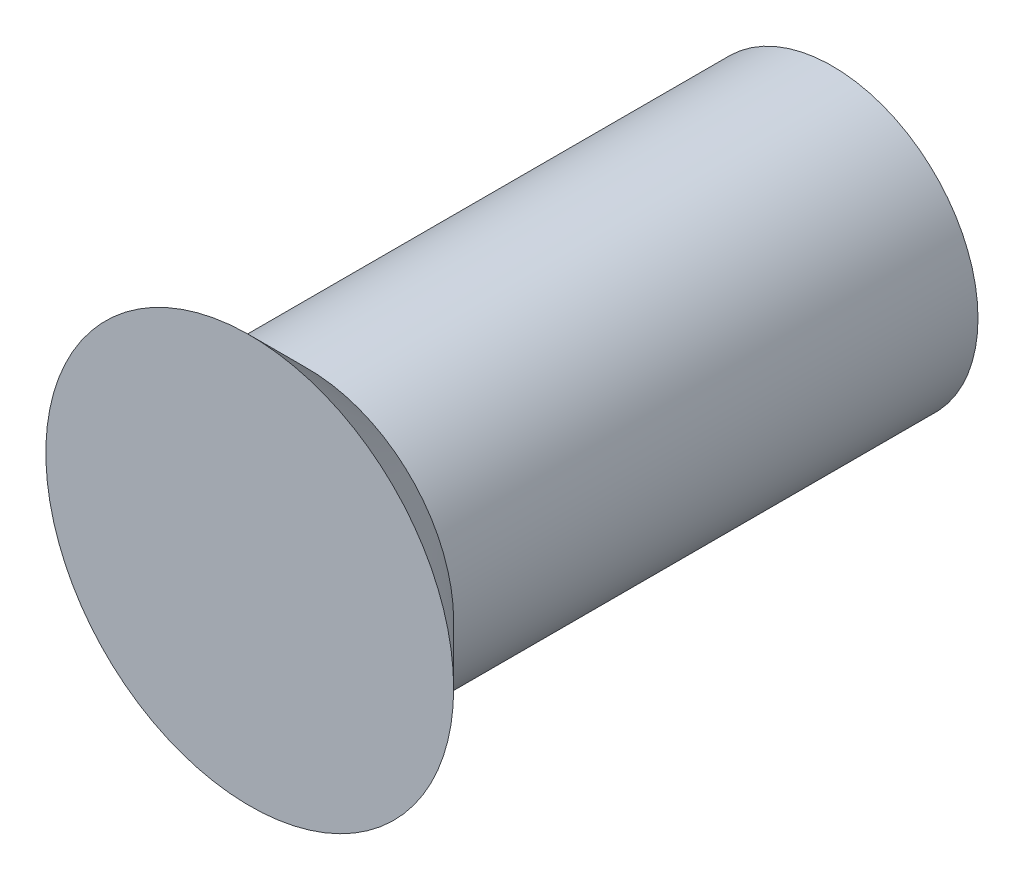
ISO-10303-21;
HEADER;
FILE_DESCRIPTION(('STEP AP214'),'2;1');
FILE_NAME('part.step','',(''),(''),'','','');
FILE_SCHEMA(('AUTOMOTIVE_DESIGN { 1 0 10303 214 1 1 1 1 }'));
ENDSEC;
DATA;
#1=APPLICATION_CONTEXT('core data for automotive mechanical design processes');
#2=APPLICATION_PROTOCOL_DEFINITION('international standard','automotive_design',2000,#1);
#3=PRODUCT_CONTEXT('',#1,'mechanical');
#4=PRODUCT('Part','Part','',(#3));
#5=PRODUCT_RELATED_PRODUCT_CATEGORY('part','',(#4));
#6=PRODUCT_DEFINITION_FORMATION('','',#4);
#7=PRODUCT_DEFINITION_CONTEXT('part definition',#1,'design');
#8=PRODUCT_DEFINITION('design','',#6,#7);
#9=PRODUCT_DEFINITION_SHAPE('','',#8);
#10=(LENGTH_UNIT() NAMED_UNIT(*) SI_UNIT(.MILLI.,.METRE.));
#11=(NAMED_UNIT(*) PLANE_ANGLE_UNIT() SI_UNIT($,.RADIAN.));
#12=(NAMED_UNIT(*) SI_UNIT($,.STERADIAN.) SOLID_ANGLE_UNIT());
#13=UNCERTAINTY_MEASURE_WITH_UNIT(LENGTH_MEASURE(1.E-05),#10,'distance_accuracy_value','');
#14=(GEOMETRIC_REPRESENTATION_CONTEXT(3) GLOBAL_UNCERTAINTY_ASSIGNED_CONTEXT((#13)) GLOBAL_UNIT_ASSIGNED_CONTEXT((#10,
#11,#12)) REPRESENTATION_CONTEXT('',''));
#15=CARTESIAN_POINT('',(0.,0.,0.));
#16=DIRECTION('',(0.,0.,1.));
#17=DIRECTION('',(1.,0.,0.));
#18=AXIS2_PLACEMENT_3D('',#15,#16,#17);
#19=CARTESIAN_POINT('',(0.,0.,9.));
#20=DIRECTION('',(0.,0.,-1.));
#21=DIRECTION('',(-1.,0.,0.));
#22=AXIS2_PLACEMENT_3D('',#19,#20,#21);
#23=CYLINDRICAL_SURFACE('',#22,2.5);
#24=CARTESIAN_POINT('',(0.,0.,9.));
#25=DIRECTION('',(0.,0.,1.));
#26=DIRECTION('',(1.,0.,0.));
#27=AXIS2_PLACEMENT_3D('',#24,#25,#26);
#28=CIRCLE('',#27,2.5);
#29=CARTESIAN_POINT('',(2.5,0.,9.));
#30=VERTEX_POINT('',#29);
#31=EDGE_CURVE('E10',#30,#30,#28,.T.);
#32=ORIENTED_EDGE('',*,*,#31,.F.);
#33=EDGE_LOOP('',(#32));
#34=FACE_BOUND('',#33,.T.);
#35=CARTESIAN_POINT('',(0.,0.,0.));
#36=DIRECTION('',(0.,0.,1.));
#37=DIRECTION('',(1.,0.,0.));
#38=AXIS2_PLACEMENT_3D('',#35,#36,#37);
#39=CIRCLE('',#38,2.5);
#40=CARTESIAN_POINT('',(2.5,0.,0.));
#41=VERTEX_POINT('',#40);
#42=EDGE_CURVE('E40',#41,#41,#39,.T.);
#43=ORIENTED_EDGE('',*,*,#42,.T.);
#44=EDGE_LOOP('',(#43));
#45=FACE_BOUND('',#44,.T.);
#46=ADVANCED_FACE('F37',(#34,#45),#23,.T.);
#47=CARTESIAN_POINT('',(0.,0.,0.));
#48=DIRECTION('',(0.,0.,1.));
#49=DIRECTION('',(1.,0.,0.));
#50=AXIS2_PLACEMENT_3D('',#47,#48,#49);
#51=PLANE('',#50);
#52=ORIENTED_EDGE('',*,*,#42,.F.);
#53=EDGE_LOOP('',(#52));
#54=FACE_BOUND('',#53,.T.);
#55=ADVANCED_FACE('F59',(#54),#51,.F.);
#56=CARTESIAN_POINT('',(0.,0.,9.));
#57=DIRECTION('',(0.,0.,1.));
#58=DIRECTION('',(1.,0.,0.));
#59=AXIS2_PLACEMENT_3D('',#56,#57,#58);
#60=CONICAL_SURFACE('',#59,2.5,0.78539816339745);
#61=CARTESIAN_POINT('',(0.,0.,10.));
#62=DIRECTION('',(0.,0.,1.));
#63=DIRECTION('',(1.,0.,0.));
#64=AXIS2_PLACEMENT_3D('',#61,#62,#63);
#65=CIRCLE('',#64,3.5);
#66=CARTESIAN_POINT('',(3.5,0.,10.));
#67=VERTEX_POINT('',#66);
#68=EDGE_CURVE('E49',#67,#67,#65,.T.);
#69=ORIENTED_EDGE('',*,*,#68,.F.);
#70=EDGE_LOOP('',(#69));
#71=FACE_BOUND('',#70,.T.);
#72=ORIENTED_EDGE('',*,*,#31,.T.);
#73=EDGE_LOOP('',(#72));
#74=FACE_BOUND('',#73,.T.);
#75=ADVANCED_FACE('F57',(#71,#74),#60,.T.);
#76=CARTESIAN_POINT('',(0.,0.,10.));
#77=DIRECTION('',(0.,0.,1.));
#78=DIRECTION('',(1.,0.,0.));
#79=AXIS2_PLACEMENT_3D('',#76,#77,#78);
#80=PLANE('',#79);
#81=ORIENTED_EDGE('',*,*,#68,.T.);
#82=EDGE_LOOP('',(#81));
#83=FACE_BOUND('',#82,.T.);
#84=ADVANCED_FACE('F55',(#83),#80,.T.);
#85=CLOSED_SHELL('',(#46,#55,#75,#84));
#86=MANIFOLD_SOLID_BREP('B2',#85);
#87=ADVANCED_BREP_SHAPE_REPRESENTATION('',(#18,#86),#14);
#88=SHAPE_DEFINITION_REPRESENTATION(#9,#87);
ENDSEC;
END-ISO-10303-21;
